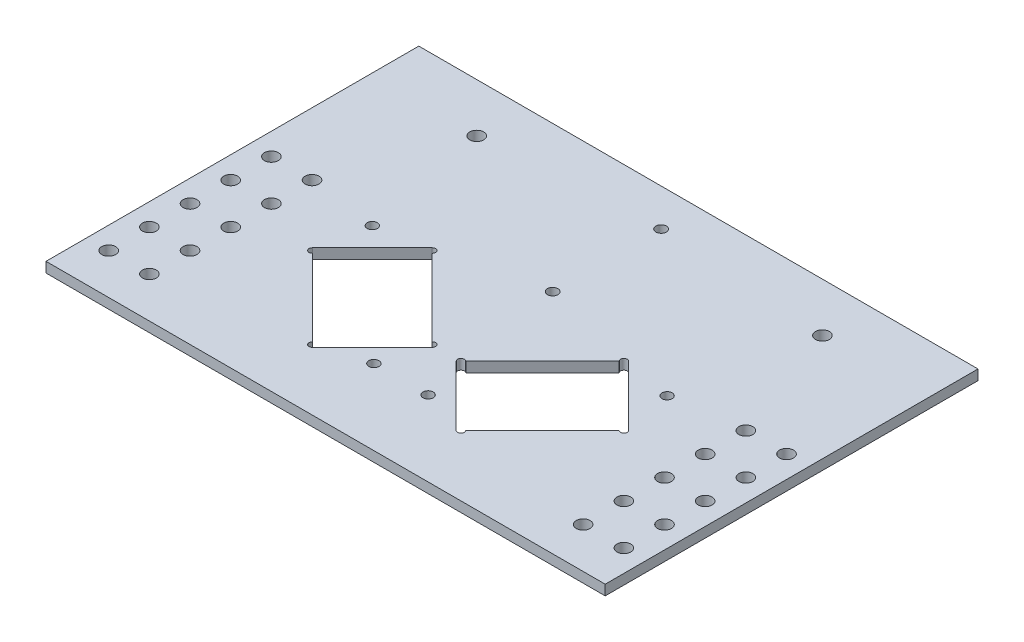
from build123d import *

# Parameters (mm, degrees)
SKETCH_1_W             = 165
SKETCH_1_H             = 110
EXTRUDE_1_DEPTH        = 3
SKETCH_2_R             = 2.05
CUT_EXTRUDE_1_DEPTH    = 199.328011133
PATTERN_LINEAR_1_COUNT = 5
PATTERN_LINEAR_1_PITCH = 12
SKETCH_4_R             = 2.05
SKETCH_4_R_2           = 1.55
SKETCH_4_R_3           = 1.5
CUT_EXTRUDE_2_DEPTH    = 199.328011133
SKETCH_5_R             = 1
CUT_EXTRUDE_3_DEPTH    = 199.328011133


with BuildPart() as part:
    # Sketch 1 → Extrude 1 (new body)
    with BuildSketch(Plane(origin=(0, 0, 0), x_dir=(1, 0, 0), z_dir=(0, 1, 0))):
        with Locations((82.5, 55)):
            Rectangle(SKETCH_1_W, SKETCH_1_H)
    extrude(amount=EXTRUDE_1_DEPTH)

    # Sketch 2 → Cut-Extrude 1 (cut, through all)
    with BuildSketch(Plane(origin=(0, 3, 0), x_dir=(1, 0, 0), z_dir=(0, 1, 0))):
        with Locations(Location((6.5, 12, 0), (0, 0, 270))):
            Circle(SKETCH_2_R)
        with Locations(Location((18.5, 12, 0), (0, 0, 270))):
            Circle(SKETCH_2_R)
        with Locations(Location((146.5, 12, 0), (0, 0, 90))):
            Circle(SKETCH_2_R)
        with Locations(Location((158.5, 12, 0), (0, 0, 90))):
            Circle(SKETCH_2_R)
    cut_extrude_1 = extrude(amount=-CUT_EXTRUDE_1_DEPTH, mode=Mode.SUBTRACT)

    # Pattern Linear 1: Cut-Extrude 1 ×5
    with Locations(*[(0, 0, -i * PATTERN_LINEAR_1_PITCH) for i in range(1, PATTERN_LINEAR_1_COUNT)]):
        add(cut_extrude_1, mode=Mode.SUBTRACT)

    # Sketch 4 → Cut-Extrude 2 (cut, through all)
    with BuildSketch(Plane(origin=(0, 3, 0), x_dir=(1, 0, 0), z_dir=(0, 1, 0))):
        with Locations(Location((133.5, 95.593678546, 0), (0, 0, 270))):
            Circle(SKETCH_4_R)
        with Locations(Location((82.5, 99, 0), (0, 0, 270))):
            Circle(SKETCH_4_R_2)
        with Locations(Location((31.5, 95.593678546, 0), (0, 0, 270))):
            Circle(SKETCH_4_R)
        with Locations(Location((82.5, 67, 0), (0, 0, 270))):
            Circle(SKETCH_4_R_2)
        with Locations(Location((125.987067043, 57.269029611, 0), (0, 0, 270))):
            Circle(SKETCH_4_R_3)
        with Locations(Location((90.5, 22.246428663, 0), (0, 0, 270))):
            Circle(SKETCH_4_R_3)
        with Locations(Location((74.5, 22.246428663, 0), (0, 0, 270))):
            Circle(SKETCH_4_R_3)
        with Locations(Location((39.012932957, 57.269029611, 0), (0, 0, 270))):
            Circle(SKETCH_4_R_3)
        Polygon((78.964466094, 34.995166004), (61.286796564, 17.317496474), (35.830952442, 42.773340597), (53.508621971, 60.451010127), align=None)
        Polygon((111.491378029, 60.451010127), (86.035533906, 34.995166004), (103.713203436, 17.317496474), (129.169047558, 42.773340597), align=None)
    extrude(amount=-CUT_EXTRUDE_2_DEPTH, mode=Mode.SUBTRACT)

    # Sketch 5 → Cut-Extrude 3 (cut, through all)
    with BuildSketch(Plane(origin=(0, 3, 0), x_dir=(1, 0, 0), z_dir=(0, 1, 0))):
        with Locations((54.215728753, 59.743903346)):
            Circle(SKETCH_5_R)
        with Locations((78.257359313, 35.702272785)):
            Circle(SKETCH_5_R)
        with Locations((60.579689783, 18.024603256)):
            Circle(SKETCH_5_R)
        with Locations((36.538059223, 42.066233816)):
            Circle(SKETCH_5_R)
        with Locations((86.742640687, 35.702272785)):
            Circle(SKETCH_5_R)
        with Locations((104.420310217, 18.024603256)):
            Circle(SKETCH_5_R)
        with Locations((128.461940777, 42.066233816)):
            Circle(SKETCH_5_R)
        with Locations((110.784271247, 59.743903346)):
            Circle(SKETCH_5_R)
    extrude(amount=-CUT_EXTRUDE_3_DEPTH, mode=Mode.SUBTRACT)


solid = part.part
